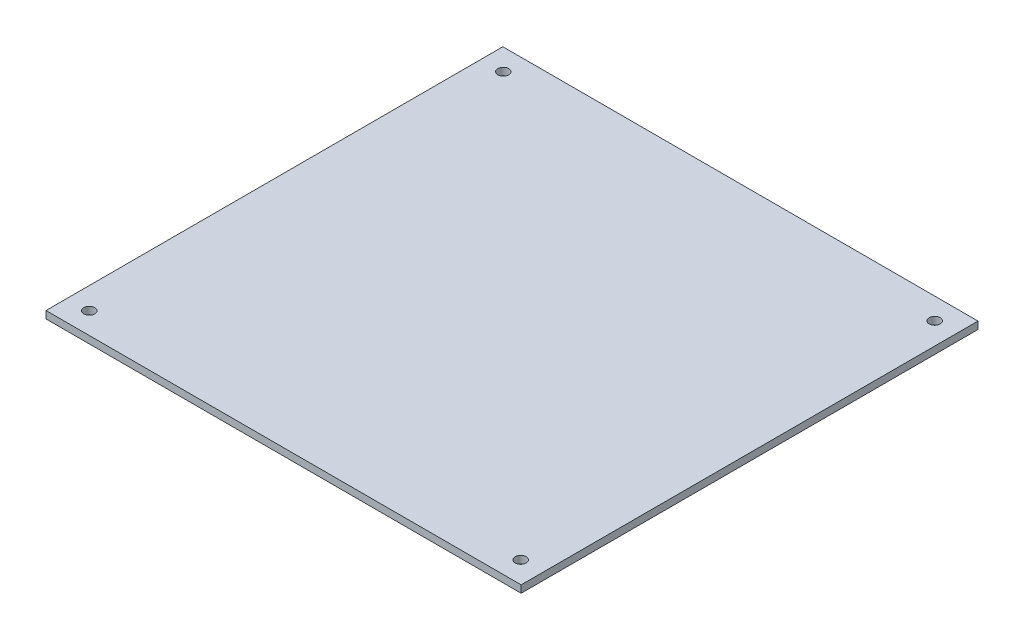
from build123d import *

# Parameters (mm, degrees)
ESQUISSE1_W        = 130
ESQUISSE1_H        = 125
ESQUISSE1_R        = 1.5
BOSS_EXTRU_1_DEPTH = 2


with BuildPart() as part:
    # Esquisse1 → Boss.-Extru.1 (new body)
    with BuildSketch(Plane(origin=(0, 0, 0), x_dir=(1, 0, 0), z_dir=(0, 1, 0))):
        with Locations((1.00423166, -0.125528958)):
            Rectangle(ESQUISSE1_W, ESQUISSE1_H)
        with Locations(Location((-58.015078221, -56.763124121, 0), (0, 0, 270))):
            Circle(ESQUISSE1_R, mode=Mode.SUBTRACT)
        with Locations(Location((60.023541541, -56.763124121, 0), (0, 0, 270))):
            Circle(ESQUISSE1_R, mode=Mode.SUBTRACT)
        with Locations(Location((60.023541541, 56.512066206, 0), (0, 0, 270))):
            Circle(ESQUISSE1_R, mode=Mode.SUBTRACT)
        with Locations(Location((-58.015078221, 56.512066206, 0), (0, 0, 270))):
            Circle(ESQUISSE1_R, mode=Mode.SUBTRACT)
    extrude(amount=BOSS_EXTRU_1_DEPTH)


solid = part.part
